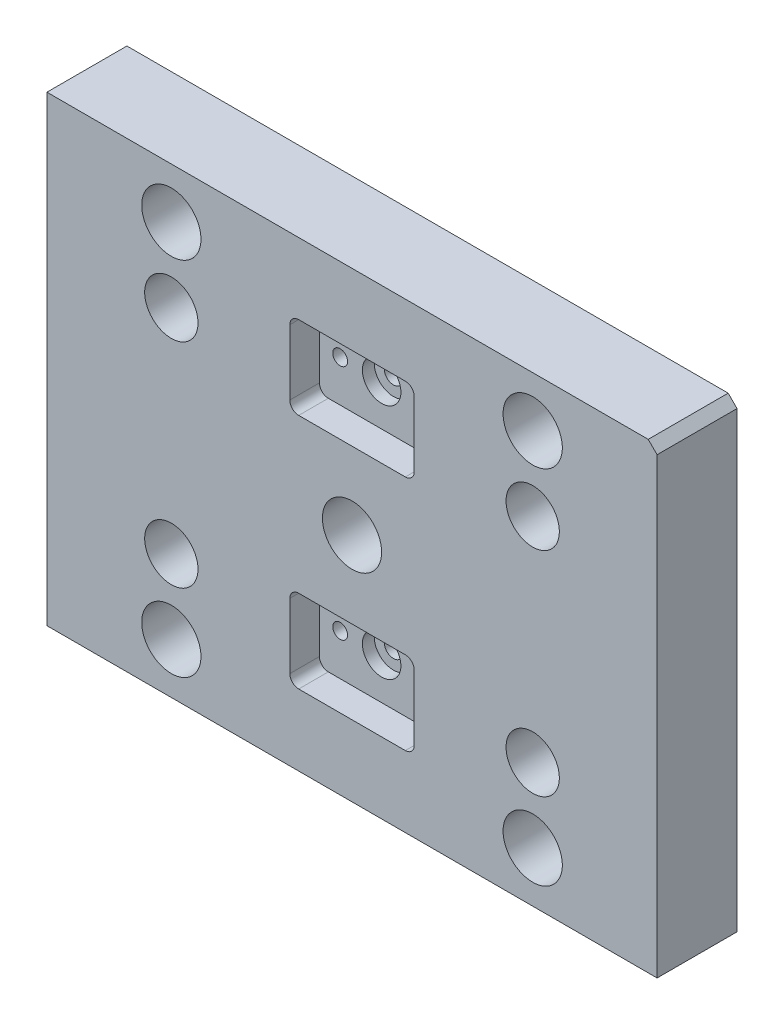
from build123d import *

# Parameters (mm, degrees)
ESQUISSE1_W                 = 206
ESQUISSE1_H                 = 156
EXTRUSION1_DEPTH            = 27
ESQUISSE3_R                 = 10
ESQUISSE3_R_2               = 5.25
ENL_V_MAT_EXTRU_1_DEPTH     = 132.992424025
ESQUISSE13_R                = 9
ENL_V_MAT_EXTRU_9_DEPTH     = 13
SYM_TRIE2_COPY_1_SKETCH_R   = 10
SYM_TRIE2_COPY_1_SKETCH_R_2 = 5.25
SYM_TRIE2_COPY_1_DEPTH      = 132.992424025
SYM_TRIE2_COPY_2_SKETCH_R   = 9
SYM_TRIE2_COPY_2_DEPTH      = 13
ESQUISSE10_W                = 42
ESQUISSE10_H                = 28
ENL_V_MAT_EXTRU_6_DEPTH     = 10
CONG_1_R                    = 3
ESQUISSE17_R                = 10
ENL_V_MAT_EXTRU_12_DEPTH    = 132.992424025
CHANFREIN_D_SIZE            = 3
CONG_1_OF_SYM_TRIE3_R       = 3
ESQUISSE18_R                = 3.1
ENL_V_MAT_EXTRU_13_DEPTH    = 132.992424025
ESQUISSE19_R                = 6.5
ENL_V_MAT_EXTRU_14_DEPTH    = 4
TROU_TARAUD_M61_AT_2_COUNT  = 2
TROU_TARAUD_M61_AT_2_PITCH  = 28


with BuildPart() as part:
    # Esquisse1 → Extrusion1 (new body)
    with BuildSketch(Plane.XY):
        Rectangle(ESQUISSE1_W, ESQUISSE1_H)
    extrude(amount=EXTRUSION1_DEPTH)

    # Esquisse3 → Enl_v. mat.-Extru.1 (cut, through all)
    with BuildSketch(Plane.XY.offset(27)):
        with Locations((-61, 61)):
            Circle(ESQUISSE3_R)
        with Locations((-61, 36)):
            Circle(ESQUISSE3_R_2)
    enl_v_mat_extru_1 = extrude(amount=-ENL_V_MAT_EXTRU_1_DEPTH, mode=Mode.SUBTRACT)

    # Esquisse13 → Enl_v. mat.-Extru.9 (cut)
    with BuildSketch(Plane.XY.offset(27)):
        with Locations((-61, 36)):
            Circle(ESQUISSE13_R)
    enl_v_mat_extru_9 = extrude(amount=-ENL_V_MAT_EXTRU_9_DEPTH, mode=Mode.SUBTRACT)

    # Sym_trie1: Enl_v. mat.-Extru.1, Enl_v. mat.-Extru.9 across plane
    add(enl_v_mat_extru_1.mirror(Plane(origin=(0, 0, 0), x_dir=(0, 0, 1), z_dir=(1, 0, 0))), mode=Mode.SUBTRACT)
    add(enl_v_mat_extru_9.mirror(Plane(origin=(0, 0, 0), x_dir=(0, 0, 1), z_dir=(1, 0, 0))), mode=Mode.SUBTRACT)

    # Sym_trie2: Enl_v. mat.-Extru.1, Enl_v. mat.-Extru.9 across plane
    add(enl_v_mat_extru_1.mirror(Plane.ZX), mode=Mode.SUBTRACT)
    add(enl_v_mat_extru_9.mirror(Plane.ZX), mode=Mode.SUBTRACT)

    # Sym_trie2 copy 1 sketch → Sym_trie2 copy 1 (cut, through all)
    with BuildSketch(Plane(origin=(0, 0, 27), x_dir=(-1, 0, 0), z_dir=(0, 0, 1))):
        with Locations((-61, 61)):
            Circle(SYM_TRIE2_COPY_1_SKETCH_R)
        with Locations((-61, 36)):
            Circle(SYM_TRIE2_COPY_1_SKETCH_R_2)
    extrude(amount=-SYM_TRIE2_COPY_1_DEPTH, mode=Mode.SUBTRACT)

    # Sym_trie2 copy 2 sketch → Sym_trie2 copy 2 (cut)
    with BuildSketch(Plane(origin=(0, 0, 27), x_dir=(-1, 0, 0), z_dir=(0, 0, 1))):
        with Locations((-61, 36)):
            Circle(SYM_TRIE2_COPY_2_SKETCH_R)
    extrude(amount=-SYM_TRIE2_COPY_2_DEPTH, mode=Mode.SUBTRACT)

    # Esquisse10 → Enl_v. mat.-Extru.6 (cut)
    with BuildSketch(Plane.XY.offset(27)):
        with Locations((0, -40)):
            Rectangle(ESQUISSE10_W, ESQUISSE10_H)
    enl_v_mat_extru_6 = extrude(amount=-ENL_V_MAT_EXTRU_6_DEPTH, mode=Mode.SUBTRACT)

    # Cong_1
    cong_1_edges = [part.edges().sort_by_distance(p)[0] for p in [
        (-21, -54, 22),
        (-21, -26, 22),
        (21, -26, 22),
        (21, -54, 22),
    ]]
    fillet(cong_1_edges, radius=CONG_1_R)

    # Esquisse17 → Enl_v. mat.-Extru.12 (cut, through all)
    with BuildSketch(Plane.XY.offset(27)):
        Circle(ESQUISSE17_R)
    extrude(amount=-ENL_V_MAT_EXTRU_12_DEPTH, mode=Mode.SUBTRACT)

    # Chanfrein_D
    chanfrein_d_edges = [part.edges().sort_by_distance(p)[0] for p in [
        (103, 78, 13.5),
    ]]
    chamfer(chanfrein_d_edges, length=CHANFREIN_D_SIZE)

    # Sym_trie3: Enl_v. mat.-Extru.6 across plane
    add(enl_v_mat_extru_6.mirror(Plane.ZX), mode=Mode.SUBTRACT)

    # Cong_1 of Sym_trie3
    cong_1_of_sym_trie3_edges = [part.edges().sort_by_distance(p)[0] for p in [
        (-21, 54, 22),
        (-21, 26, 22),
        (21, 26, 22),
        (21, 54, 22),
    ]]
    fillet(cong_1_of_sym_trie3_edges, radius=CONG_1_OF_SYM_TRIE3_R)

    # Esquisse18 → Enl_v. mat.-Extru.13 (cut, through all)
    with BuildSketch(Plane(origin=(0, 0, 0), x_dir=(-1, 0, 0), z_dir=(0, 0, -1))):
        with Locations((0, -40)):
            Circle(ESQUISSE18_R)
        with Locations((0, 40)):
            Circle(ESQUISSE18_R)
    extrude(amount=-ENL_V_MAT_EXTRU_13_DEPTH, mode=Mode.SUBTRACT)

    # Esquisse19 → Enl_v. mat.-Extru.14 (cut)
    with BuildSketch(Plane.XY.offset(17)):
        with Locations((0, 40)):
            Circle(ESQUISSE19_R)
        with Locations((0, -40)):
            Circle(ESQUISSE19_R)
    extrude(amount=-ENL_V_MAT_EXTRU_14_DEPTH, mode=Mode.SUBTRACT)

    # Esquisse21 → Trou taraud_ M61 (revolve, cut)
    with BuildSketch(Plane(origin=(14, 40, 17), x_dir=(0, -1, 0), z_dir=(1, 0, 0))):
        Polygon((0, 0), (0, 18.502151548), (2.5, 17), (2.5, 0), align=None)
    trou_taraud_m61 = revolve(axis=Axis((14, 40, 23.35), (0, 0, -1)), mode=Mode.SUBTRACT)

    # Trou taraud_ M61 at 2: Trou taraud_ M61 ×2
    with Locations(*[(-i * TROU_TARAUD_M61_AT_2_PITCH, 0, 0) for i in range(1, TROU_TARAUD_M61_AT_2_COUNT)]):
        add(trou_taraud_m61, mode=Mode.SUBTRACT)

    # Sym_trie4: Trou taraud_ M61 across plane
    add(trou_taraud_m61.mirror(Plane.ZX), mode=Mode.SUBTRACT)

    # Sym_trie4 copy 1 sketch → Sym_trie4 copy 1 (revolve, cut)
    with BuildSketch(Plane(origin=(-14, -40, 17), x_dir=(0, 1, 0), z_dir=(1, 0, 0))):
        Polygon((0, 0), (0, -18.502151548), (2.5, -17), (2.5, 0), align=None)
    revolve(axis=Axis((-14, -40, 23.35), (0, 0, 1)), mode=Mode.SUBTRACT)


solid = part.part
